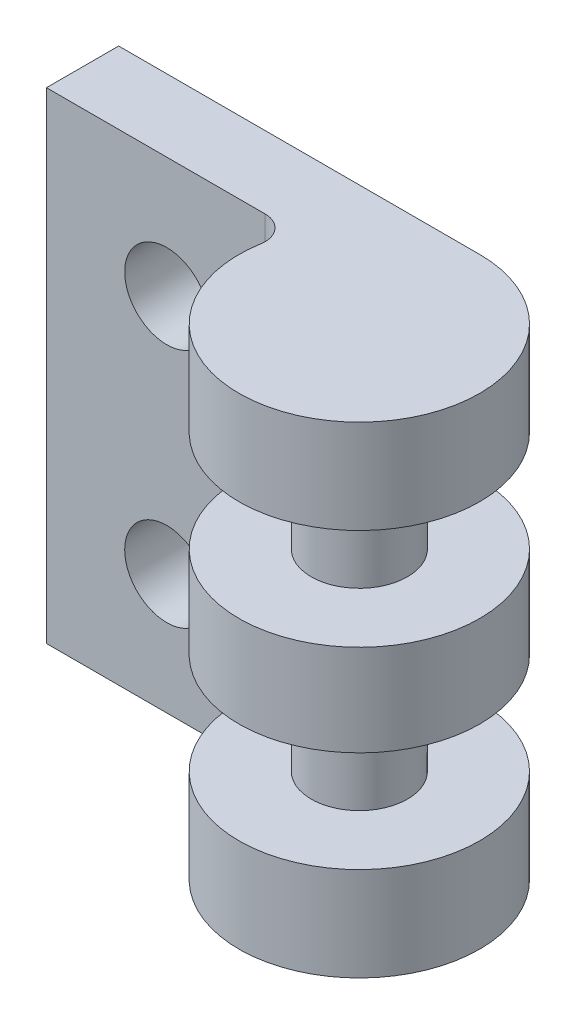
from build123d import *

# Parameters (mm, degrees)
SKETCH1_W           = 10
SKETCH1_H           = 20
SKETCH1_R           = 1.75
BOSS_EXTRUDE1_DEPTH = 3
BOSS_EXTRUDE2_DEPTH = 10
SKETCH3_W           = 10
SKETCH3_H           = 4.2
CUT_EXTRUDE1_DEPTH  = 10
SKETCH4_R           = 2
BOSS_EXTRUDE3_DEPTH = 10
FILLET1_R           = 1
FILLET2_R           = 1


with BuildPart() as part:
    # Sketch1 → Boss-Extrude1 (new body)
    with BuildSketch(Plane.XY):
        Rectangle(SKETCH1_W, SKETCH1_H)
        with Locations((0, 5)):
            Circle(SKETCH1_R, mode=Mode.SUBTRACT)
        with Locations(Location((0, -5, 0), (0, 0, 180))):
            Circle(SKETCH1_R, mode=Mode.SUBTRACT)
    extrude(amount=BOSS_EXTRUDE1_DEPTH)

    # Sketch2 → Boss-Extrude2 (add, symmetric)
    with BuildSketch(Plane(origin=(0, 0, 0), x_dir=(1, 0, 0), z_dir=(0, 1, 0))):
        with BuildLine():
            Line((5, -3), (5.417424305, -3))
            ThreePointArc((5.417424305, -3), (12.738612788, -9.183300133), (10, 0))
            Line((10, 0), (5, 0))
            Line((5, 0), (5, -3))
        make_face()
    extrude(amount=BOSS_EXTRUDE2_DEPTH, both=True)

    # Sketch3 → Cut-Extrude1 (cut, symmetric)
    with BuildSketch(Plane.XY.offset(3)):
        with Locations((10, 4)):
            Rectangle(SKETCH3_W, SKETCH3_H)
        with Locations((10, -4)):
            Rectangle(SKETCH3_W, SKETCH3_H)
    extrude(amount=CUT_EXTRUDE1_DEPTH, both=True, mode=Mode.SUBTRACT)

    # Sketch4 → Boss-Extrude3 (add, symmetric)
    with BuildSketch(Plane(origin=(0, 0, 0), x_dir=(1, 0, 0), z_dir=(0, 1, 0))):
        with Locations((10, -5)):
            Circle(SKETCH4_R)
    extrude(amount=BOSS_EXTRUDE3_DEPTH, both=True)

    # Fillet1
    fillet1_edges = [part.edges().sort_by_distance(p)[0] for p in [
        (5, 4, 3),
        (5, -4, 3),
    ]]
    fillet(fillet1_edges, radius=FILLET1_R)

    # Fillet2
    fillet2_edges = [part.edges().sort_by_distance(p)[0] for p in [
        (5.417424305, 8.05, 3),
        (5.417424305, 0, 3),
        (5.417424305, -8.05, 3),
    ]]
    fillet(fillet2_edges, radius=FILLET2_R)


solid = part.part
